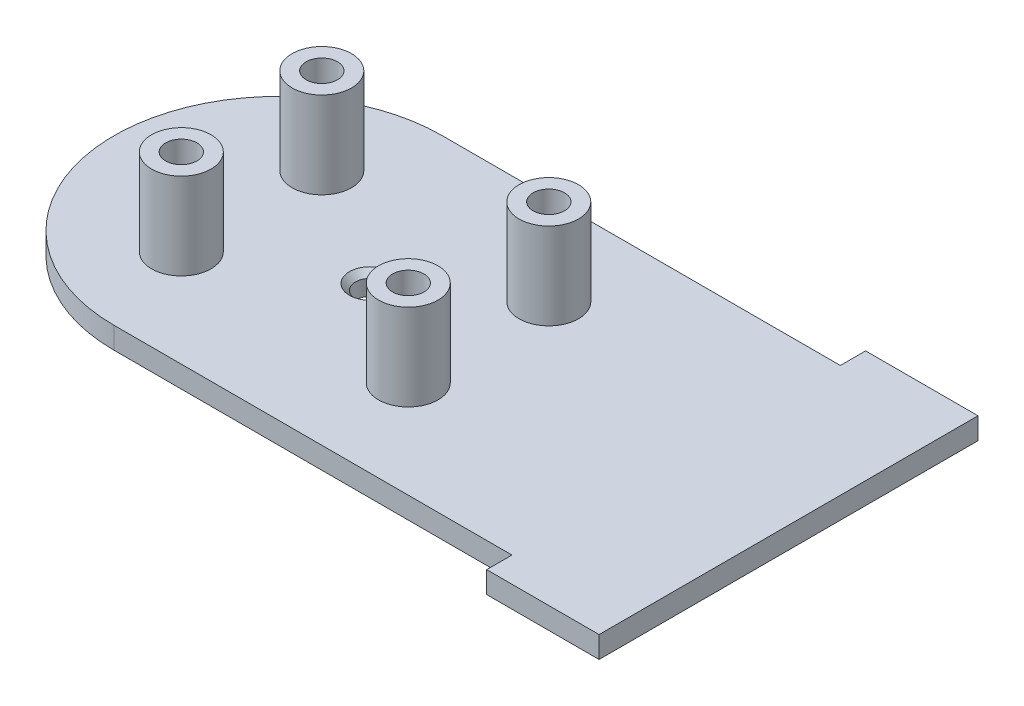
ISO-10303-21;
HEADER;
FILE_DESCRIPTION(('STEP AP214'),'2;1');
FILE_NAME('part.step','',(''),(''),'','','');
FILE_SCHEMA(('AUTOMOTIVE_DESIGN { 1 0 10303 214 1 1 1 1 }'));
ENDSEC;
DATA;
#1=APPLICATION_CONTEXT('core data for automotive mechanical design processes');
#2=APPLICATION_PROTOCOL_DEFINITION('international standard','automotive_design',2000,#1);
#3=PRODUCT_CONTEXT('',#1,'mechanical');
#4=PRODUCT('Part','Part','',(#3));
#5=PRODUCT_RELATED_PRODUCT_CATEGORY('part','',(#4));
#6=PRODUCT_DEFINITION_FORMATION('','',#4);
#7=PRODUCT_DEFINITION_CONTEXT('part definition',#1,'design');
#8=PRODUCT_DEFINITION('design','',#6,#7);
#9=PRODUCT_DEFINITION_SHAPE('','',#8);
#10=(LENGTH_UNIT() NAMED_UNIT(*) SI_UNIT(.MILLI.,.METRE.));
#11=(NAMED_UNIT(*) PLANE_ANGLE_UNIT() SI_UNIT($,.RADIAN.));
#12=(NAMED_UNIT(*) SI_UNIT($,.STERADIAN.) SOLID_ANGLE_UNIT());
#13=UNCERTAINTY_MEASURE_WITH_UNIT(LENGTH_MEASURE(1.E-05),#10,'distance_accuracy_value','');
#14=(GEOMETRIC_REPRESENTATION_CONTEXT(3) GLOBAL_UNCERTAINTY_ASSIGNED_CONTEXT((#13)) GLOBAL_UNIT_ASSIGNED_CONTEXT((#10,
#11,#12)) REPRESENTATION_CONTEXT('',''));
#15=CARTESIAN_POINT('',(0.,0.,0.));
#16=DIRECTION('',(0.,0.,1.));
#17=DIRECTION('',(1.,0.,0.));
#18=AXIS2_PLACEMENT_3D('',#15,#16,#17);
#19=CARTESIAN_POINT('',(8.5,0.,0.));
#20=DIRECTION('',(0.,1.,0.));
#21=DIRECTION('',(0.,0.,1.));
#22=AXIS2_PLACEMENT_3D('',#19,#20,#21);
#23=CYLINDRICAL_SURFACE('',#22,1.35);
#24=CARTESIAN_POINT('',(8.5,0.,0.));
#25=DIRECTION('',(0.,1.,0.));
#26=DIRECTION('',(0.,0.,1.));
#27=AXIS2_PLACEMENT_3D('',#24,#25,#26);
#28=CIRCLE('',#27,1.35);
#29=CARTESIAN_POINT('',(8.5,0.,1.35));
#30=VERTEX_POINT('',#29);
#31=EDGE_CURVE('E208',#30,#30,#28,.T.);
#32=ORIENTED_EDGE('',*,*,#31,.F.);
#33=EDGE_LOOP('',(#32));
#34=FACE_BOUND('',#33,.T.);
#35=CARTESIAN_POINT('',(8.5,1.45000000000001,0.));
#36=DIRECTION('',(0.,1.,0.));
#37=DIRECTION('',(0.,0.,1.));
#38=AXIS2_PLACEMENT_3D('',#35,#36,#37);
#39=CIRCLE('',#38,1.35);
#40=CARTESIAN_POINT('',(8.5,1.45000000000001,1.35));
#41=VERTEX_POINT('',#40);
#42=EDGE_CURVE('E207',#41,#41,#39,.F.);
#43=ORIENTED_EDGE('',*,*,#42,.F.);
#44=EDGE_LOOP('',(#43));
#45=FACE_BOUND('',#44,.T.);
#46=ADVANCED_FACE('F44',(#34,#45),#23,.F.);
#47=CARTESIAN_POINT('',(0.,2.,0.));
#48=DIRECTION('',(0.,-1.,0.));
#49=DIRECTION('',(0.,0.,-1.));
#50=AXIS2_PLACEMENT_3D('',#47,#48,#49);
#51=CYLINDRICAL_SURFACE('',#50,15.19);
#52=CARTESIAN_POINT('',(0.,0.,0.));
#53=DIRECTION('',(0.,1.,0.));
#54=DIRECTION('',(0.,0.,1.));
#55=AXIS2_PLACEMENT_3D('',#52,#53,#54);
#56=CIRCLE('',#55,15.19);
#57=CARTESIAN_POINT('',(0.,0.,-15.19));
#58=VERTEX_POINT('',#57);
#59=CARTESIAN_POINT('',(0.,0.,15.19));
#60=VERTEX_POINT('',#59);
#61=EDGE_CURVE('E212',#58,#60,#56,.T.);
#62=ORIENTED_EDGE('',*,*,#61,.T.);
#63=DIRECTION('',(0.,-1.,0.));
#64=VECTOR('',#63,1.);
#65=CARTESIAN_POINT('',(0.,2.,15.19));
#66=LINE('',#65,#64);
#67=CARTESIAN_POINT('',(0.,2.,15.19));
#68=VERTEX_POINT('',#67);
#69=EDGE_CURVE('E12',#68,#60,#66,.T.);
#70=ORIENTED_EDGE('',*,*,#69,.F.);
#71=CARTESIAN_POINT('',(0.,2.,0.));
#72=DIRECTION('',(0.,1.,0.));
#73=DIRECTION('',(0.,0.,1.));
#74=AXIS2_PLACEMENT_3D('',#71,#72,#73);
#75=CIRCLE('',#74,15.19);
#76=CARTESIAN_POINT('',(0.,2.,-15.19));
#77=VERTEX_POINT('',#76);
#78=EDGE_CURVE('E213',#77,#68,#75,.T.);
#79=ORIENTED_EDGE('',*,*,#78,.F.);
#80=DIRECTION('',(0.,-1.,0.));
#81=VECTOR('',#80,1.);
#82=CARTESIAN_POINT('',(0.,2.,-15.19));
#83=LINE('',#82,#81);
#84=EDGE_CURVE('E64',#77,#58,#83,.T.);
#85=ORIENTED_EDGE('',*,*,#84,.T.);
#86=EDGE_LOOP('',(#62,#70,#79,#85));
#87=FACE_BOUND('',#86,.T.);
#88=ADVANCED_FACE('F298',(#87),#51,.T.);
#89=CARTESIAN_POINT('',(0.,2.,15.19));
#90=DIRECTION('',(0.,0.,-1.));
#91=DIRECTION('',(-1.,0.,0.));
#92=AXIS2_PLACEMENT_3D('',#89,#90,#91);
#93=PLANE('',#92);
#94=DIRECTION('',(1.,0.,0.));
#95=VECTOR('',#94,1.);
#96=CARTESIAN_POINT('',(0.,0.,15.19));
#97=LINE('',#96,#95);
#98=CARTESIAN_POINT('',(36.825,0.,15.19));
#99=VERTEX_POINT('',#98);
#100=EDGE_CURVE('E240',#60,#99,#97,.T.);
#101=ORIENTED_EDGE('',*,*,#100,.T.);
#102=DIRECTION('',(0.,-1.,0.));
#103=VECTOR('',#102,1.);
#104=CARTESIAN_POINT('',(36.825,2.,15.19));
#105=LINE('',#104,#103);
#106=CARTESIAN_POINT('',(36.825,2.,15.19));
#107=VERTEX_POINT('',#106);
#108=EDGE_CURVE('E55',#107,#99,#105,.T.);
#109=ORIENTED_EDGE('',*,*,#108,.F.);
#110=DIRECTION('',(1.,0.,0.));
#111=VECTOR('',#110,1.);
#112=CARTESIAN_POINT('',(0.,2.,15.19));
#113=LINE('',#112,#111);
#114=EDGE_CURVE('E217',#68,#107,#113,.T.);
#115=ORIENTED_EDGE('',*,*,#114,.F.);
#116=ORIENTED_EDGE('',*,*,#69,.T.);
#117=EDGE_LOOP('',(#101,#109,#115,#116));
#118=FACE_BOUND('',#117,.T.);
#119=ADVANCED_FACE('F303',(#118),#93,.F.);
#120=CARTESIAN_POINT('',(36.825,2.,15.19));
#121=DIRECTION('',(1.,0.,0.));
#122=DIRECTION('',(0.,0.,-1.));
#123=AXIS2_PLACEMENT_3D('',#120,#121,#122);
#124=PLANE('',#123);
#125=DIRECTION('',(0.,0.,1.));
#126=VECTOR('',#125,1.);
#127=CARTESIAN_POINT('',(36.825,0.,15.19));
#128=LINE('',#127,#126);
#129=CARTESIAN_POINT('',(36.825,0.,17.5294293));
#130=VERTEX_POINT('',#129);
#131=EDGE_CURVE('E243',#99,#130,#128,.T.);
#132=ORIENTED_EDGE('',*,*,#131,.T.);
#133=DIRECTION('',(0.,-1.,0.));
#134=VECTOR('',#133,1.);
#135=CARTESIAN_POINT('',(36.825,2.,17.5294293));
#136=LINE('',#135,#134);
#137=CARTESIAN_POINT('',(36.825,2.,17.5294293));
#138=VERTEX_POINT('',#137);
#139=EDGE_CURVE('E269',#138,#130,#136,.T.);
#140=ORIENTED_EDGE('',*,*,#139,.F.);
#141=DIRECTION('',(0.,0.,1.));
#142=VECTOR('',#141,1.);
#143=CARTESIAN_POINT('',(36.825,2.,15.19));
#144=LINE('',#143,#142);
#145=EDGE_CURVE('E221',#107,#138,#144,.T.);
#146=ORIENTED_EDGE('',*,*,#145,.F.);
#147=ORIENTED_EDGE('',*,*,#108,.T.);
#148=EDGE_LOOP('',(#132,#140,#146,#147));
#149=FACE_BOUND('',#148,.T.);
#150=ADVANCED_FACE('F305',(#149),#124,.F.);
#151=CARTESIAN_POINT('',(47.225,2.,17.5294293));
#152=DIRECTION('',(0.,0.,1.));
#153=DIRECTION('',(1.,0.,0.));
#154=AXIS2_PLACEMENT_3D('',#151,#152,#153);
#155=PLANE('',#154);
#156=DIRECTION('',(-1.,0.,0.));
#157=VECTOR('',#156,1.);
#158=CARTESIAN_POINT('',(47.225,0.,17.5294293));
#159=LINE('',#158,#157);
#160=CARTESIAN_POINT('',(47.225,0.,17.5294293));
#161=VERTEX_POINT('',#160);
#162=EDGE_CURVE('E247',#161,#130,#159,.T.);
#163=ORIENTED_EDGE('',*,*,#162,.F.);
#164=DIRECTION('',(0.,-1.,0.));
#165=VECTOR('',#164,1.);
#166=CARTESIAN_POINT('',(47.225,2.,17.5294293));
#167=LINE('',#166,#165);
#168=CARTESIAN_POINT('',(47.225,2.,17.5294293));
#169=VERTEX_POINT('',#168);
#170=EDGE_CURVE('E112',#169,#161,#167,.T.);
#171=ORIENTED_EDGE('',*,*,#170,.F.);
#172=DIRECTION('',(-1.,0.,0.));
#173=VECTOR('',#172,1.);
#174=CARTESIAN_POINT('',(47.225,2.,17.5294293));
#175=LINE('',#174,#173);
#176=EDGE_CURVE('E224',#169,#138,#175,.T.);
#177=ORIENTED_EDGE('',*,*,#176,.T.);
#178=ORIENTED_EDGE('',*,*,#139,.T.);
#179=EDGE_LOOP('',(#163,#171,#177,#178));
#180=FACE_BOUND('',#179,.T.);
#181=ADVANCED_FACE('F306',(#180),#155,.T.);
#182=CARTESIAN_POINT('',(47.225,2.,-17.5294293));
#183=DIRECTION('',(1.,0.,0.));
#184=DIRECTION('',(0.,0.,-1.));
#185=AXIS2_PLACEMENT_3D('',#182,#183,#184);
#186=PLANE('',#185);
#187=DIRECTION('',(0.,0.,1.));
#188=VECTOR('',#187,1.);
#189=CARTESIAN_POINT('',(47.225,0.,-17.5294293));
#190=LINE('',#189,#188);
#191=CARTESIAN_POINT('',(47.225,0.,-17.5294293));
#192=VERTEX_POINT('',#191);
#193=EDGE_CURVE('E251',#192,#161,#190,.T.);
#194=ORIENTED_EDGE('',*,*,#193,.F.);
#195=DIRECTION('',(0.,-1.,0.));
#196=VECTOR('',#195,1.);
#197=CARTESIAN_POINT('',(47.225,2.,-17.5294293));
#198=LINE('',#197,#196);
#199=CARTESIAN_POINT('',(47.225,2.,-17.5294293));
#200=VERTEX_POINT('',#199);
#201=EDGE_CURVE('E105',#200,#192,#198,.T.);
#202=ORIENTED_EDGE('',*,*,#201,.F.);
#203=DIRECTION('',(0.,0.,1.));
#204=VECTOR('',#203,1.);
#205=CARTESIAN_POINT('',(47.225,2.,-17.5294293));
#206=LINE('',#205,#204);
#207=EDGE_CURVE('E227',#200,#169,#206,.T.);
#208=ORIENTED_EDGE('',*,*,#207,.T.);
#209=ORIENTED_EDGE('',*,*,#170,.T.);
#210=EDGE_LOOP('',(#194,#202,#208,#209));
#211=FACE_BOUND('',#210,.T.);
#212=ADVANCED_FACE('F307',(#211),#186,.T.);
#213=CARTESIAN_POINT('',(38.325,2.,-17.5294293));
#214=DIRECTION('',(0.,0.,-1.));
#215=DIRECTION('',(-1.,0.,0.));
#216=AXIS2_PLACEMENT_3D('',#213,#214,#215);
#217=PLANE('',#216);
#218=DIRECTION('',(1.,0.,0.));
#219=VECTOR('',#218,1.);
#220=CARTESIAN_POINT('',(38.325,0.,-17.5294293));
#221=LINE('',#220,#219);
#222=CARTESIAN_POINT('',(36.825,0.,-17.5294293));
#223=VERTEX_POINT('',#222);
#224=EDGE_CURVE('E255',#223,#192,#221,.T.);
#225=ORIENTED_EDGE('',*,*,#224,.F.);
#226=DIRECTION('',(0.,-1.,0.));
#227=VECTOR('',#226,1.);
#228=CARTESIAN_POINT('',(36.825,2.,-17.5294293));
#229=LINE('',#228,#227);
#230=CARTESIAN_POINT('',(36.825,2.,-17.5294293));
#231=VERTEX_POINT('',#230);
#232=EDGE_CURVE('E98',#231,#223,#229,.T.);
#233=ORIENTED_EDGE('',*,*,#232,.F.);
#234=DIRECTION('',(1.,0.,0.));
#235=VECTOR('',#234,1.);
#236=CARTESIAN_POINT('',(38.325,2.,-17.5294293));
#237=LINE('',#236,#235);
#238=EDGE_CURVE('E230',#231,#200,#237,.T.);
#239=ORIENTED_EDGE('',*,*,#238,.T.);
#240=ORIENTED_EDGE('',*,*,#201,.T.);
#241=EDGE_LOOP('',(#225,#233,#239,#240));
#242=FACE_BOUND('',#241,.T.);
#243=ADVANCED_FACE('F308',(#242),#217,.T.);
#244=CARTESIAN_POINT('',(36.825,2.,-15.19));
#245=DIRECTION('',(-1.,0.,0.));
#246=DIRECTION('',(0.,0.,1.));
#247=AXIS2_PLACEMENT_3D('',#244,#245,#246);
#248=PLANE('',#247);
#249=DIRECTION('',(0.,0.,-1.));
#250=VECTOR('',#249,1.);
#251=CARTESIAN_POINT('',(36.825,0.,-15.19));
#252=LINE('',#251,#250);
#253=CARTESIAN_POINT('',(36.825,0.,-15.19));
#254=VERTEX_POINT('',#253);
#255=EDGE_CURVE('E259',#254,#223,#252,.T.);
#256=ORIENTED_EDGE('',*,*,#255,.F.);
#257=DIRECTION('',(0.,-1.,0.));
#258=VECTOR('',#257,1.);
#259=CARTESIAN_POINT('',(36.825,2.,-15.19));
#260=LINE('',#259,#258);
#261=CARTESIAN_POINT('',(36.825,2.,-15.19));
#262=VERTEX_POINT('',#261);
#263=EDGE_CURVE('E48',#262,#254,#260,.T.);
#264=ORIENTED_EDGE('',*,*,#263,.F.);
#265=DIRECTION('',(0.,0.,-1.));
#266=VECTOR('',#265,1.);
#267=CARTESIAN_POINT('',(36.825,2.,-15.19));
#268=LINE('',#267,#266);
#269=EDGE_CURVE('E233',#262,#231,#268,.T.);
#270=ORIENTED_EDGE('',*,*,#269,.T.);
#271=ORIENTED_EDGE('',*,*,#232,.T.);
#272=EDGE_LOOP('',(#256,#264,#270,#271));
#273=FACE_BOUND('',#272,.T.);
#274=ADVANCED_FACE('F46',(#273),#248,.T.);
#275=CARTESIAN_POINT('',(0.,2.,-15.19));
#276=DIRECTION('',(0.,0.,-1.));
#277=DIRECTION('',(-1.,0.,0.));
#278=AXIS2_PLACEMENT_3D('',#275,#276,#277);
#279=PLANE('',#278);
#280=DIRECTION('',(1.,0.,0.));
#281=VECTOR('',#280,1.);
#282=CARTESIAN_POINT('',(0.,0.,-15.19));
#283=LINE('',#282,#281);
#284=EDGE_CURVE('E218',#58,#254,#283,.T.);
#285=ORIENTED_EDGE('',*,*,#284,.F.);
#286=ORIENTED_EDGE('',*,*,#84,.F.);
#287=DIRECTION('',(1.,0.,0.));
#288=VECTOR('',#287,1.);
#289=CARTESIAN_POINT('',(0.,2.,-15.19));
#290=LINE('',#289,#288);
#291=EDGE_CURVE('E234',#77,#262,#290,.T.);
#292=ORIENTED_EDGE('',*,*,#291,.T.);
#293=ORIENTED_EDGE('',*,*,#263,.T.);
#294=EDGE_LOOP('',(#285,#286,#292,#293));
#295=FACE_BOUND('',#294,.T.);
#296=ADVANCED_FACE('F291',(#295),#279,.T.);
#297=CARTESIAN_POINT('',(0.,2.,0.));
#298=DIRECTION('',(0.,1.,0.));
#299=DIRECTION('',(0.,0.,1.));
#300=AXIS2_PLACEMENT_3D('',#297,#298,#299);
#301=PLANE('',#300);
#302=CARTESIAN_POINT('',(18.225,2.,6.18311674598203));
#303=DIRECTION('',(0.,1.,0.));
#304=DIRECTION('',(0.,0.,1.));
#305=AXIS2_PLACEMENT_3D('',#302,#303,#304);
#306=CIRCLE('',#305,2.75);
#307=CARTESIAN_POINT('',(18.225,2.,8.93311674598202));
#308=VERTEX_POINT('',#307);
#309=EDGE_CURVE('E677',#308,#308,#306,.T.);
#310=ORIENTED_EDGE('',*,*,#309,.F.);
#311=EDGE_LOOP('',(#310));
#312=FACE_BOUND('',#311,.T.);
#313=CARTESIAN_POINT('',(-2.77500000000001,2.,6.18311674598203));
#314=DIRECTION('',(0.,1.,0.));
#315=DIRECTION('',(0.,0.,1.));
#316=AXIS2_PLACEMENT_3D('',#313,#314,#315);
#317=CIRCLE('',#316,2.75);
#318=CARTESIAN_POINT('',(-2.77500000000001,2.,8.93311674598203));
#319=VERTEX_POINT('',#318);
#320=EDGE_CURVE('E690',#319,#319,#317,.T.);
#321=ORIENTED_EDGE('',*,*,#320,.F.);
#322=EDGE_LOOP('',(#321));
#323=FACE_BOUND('',#322,.T.);
#324=CARTESIAN_POINT('',(18.225,2.,-6.81688325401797));
#325=DIRECTION('',(0.,1.,0.));
#326=DIRECTION('',(0.,0.,1.));
#327=AXIS2_PLACEMENT_3D('',#324,#325,#326);
#328=CIRCLE('',#327,2.75);
#329=CARTESIAN_POINT('',(18.225,2.,-4.06688325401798));
#330=VERTEX_POINT('',#329);
#331=EDGE_CURVE('E698',#330,#330,#328,.T.);
#332=ORIENTED_EDGE('',*,*,#331,.F.);
#333=EDGE_LOOP('',(#332));
#334=FACE_BOUND('',#333,.T.);
#335=CARTESIAN_POINT('',(-2.77500000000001,2.,-6.81688325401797));
#336=DIRECTION('',(0.,1.,0.));
#337=DIRECTION('',(0.,0.,1.));
#338=AXIS2_PLACEMENT_3D('',#335,#336,#337);
#339=CIRCLE('',#338,2.75);
#340=CARTESIAN_POINT('',(-2.77500000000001,2.,-4.06688325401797));
#341=VERTEX_POINT('',#340);
#342=EDGE_CURVE('E702',#341,#341,#339,.T.);
#343=ORIENTED_EDGE('',*,*,#342,.F.);
#344=EDGE_LOOP('',(#343));
#345=FACE_BOUND('',#344,.T.);
#346=CARTESIAN_POINT('',(8.5,2.,0.));
#347=DIRECTION('',(0.,1.,0.));
#348=DIRECTION('',(0.,0.,1.));
#349=AXIS2_PLACEMENT_3D('',#346,#347,#348);
#350=CIRCLE('',#349,1.9);
#351=CARTESIAN_POINT('',(8.5,2.,1.9));
#352=VERTEX_POINT('',#351);
#353=EDGE_CURVE('E200',#352,#352,#350,.T.);
#354=ORIENTED_EDGE('',*,*,#353,.F.);
#355=EDGE_LOOP('',(#354));
#356=FACE_BOUND('',#355,.T.);
#357=ORIENTED_EDGE('',*,*,#78,.T.);
#358=ORIENTED_EDGE('',*,*,#114,.T.);
#359=ORIENTED_EDGE('',*,*,#145,.T.);
#360=ORIENTED_EDGE('',*,*,#176,.F.);
#361=ORIENTED_EDGE('',*,*,#207,.F.);
#362=ORIENTED_EDGE('',*,*,#238,.F.);
#363=ORIENTED_EDGE('',*,*,#269,.F.);
#364=ORIENTED_EDGE('',*,*,#291,.F.);
#365=EDGE_LOOP('',(#357,#358,#359,#360,#361,#362,#363,#364));
#366=FACE_BOUND('',#365,.T.);
#367=ADVANCED_FACE('F290',(#312,#323,#334,#345,#356,#366),#301,.T.);
#368=CARTESIAN_POINT('',(0.,0.,0.));
#369=DIRECTION('',(0.,1.,0.));
#370=DIRECTION('',(0.,0.,1.));
#371=AXIS2_PLACEMENT_3D('',#368,#369,#370);
#372=PLANE('',#371);
#373=DIRECTION('',(0.,0.,1.));
#374=VECTOR('',#373,1.);
#375=CARTESIAN_POINT('',(4.5,0.,-6.5));
#376=LINE('',#375,#374);
#377=CARTESIAN_POINT('',(4.5,0.,-12.0980762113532));
#378=VERTEX_POINT('',#377);
#379=CARTESIAN_POINT('',(4.5,0.,10.09807621));
#380=VERTEX_POINT('',#379);
#381=EDGE_CURVE('E158',#378,#380,#376,.T.);
#382=ORIENTED_EDGE('',*,*,#381,.F.);
#383=DIRECTION('',(1.,0.,0.));
#384=VECTOR('',#383,1.);
#385=CARTESIAN_POINT('',(-10.2955549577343,0.,-12.0980762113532));
#386=LINE('',#385,#384);
#387=CARTESIAN_POINT('',(-4.5,0.,-12.0980762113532));
#388=VERTEX_POINT('',#387);
#389=EDGE_CURVE('E163',#388,#378,#386,.T.);
#390=ORIENTED_EDGE('',*,*,#389,.F.);
#391=DIRECTION('',(0.,0.,-1.));
#392=VECTOR('',#391,1.);
#393=CARTESIAN_POINT('',(-4.5,0.,-6.5));
#394=LINE('',#393,#392);
#395=CARTESIAN_POINT('',(-4.5,0.,10.09807621));
#396=VERTEX_POINT('',#395);
#397=EDGE_CURVE('E146',#396,#388,#394,.T.);
#398=ORIENTED_EDGE('',*,*,#397,.F.);
#399=DIRECTION('',(1.,0.,0.));
#400=VECTOR('',#399,1.);
#401=CARTESIAN_POINT('',(-10.2955549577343,0.,10.09807621));
#402=LINE('',#401,#400);
#403=EDGE_CURVE('E182',#396,#380,#402,.T.);
#404=ORIENTED_EDGE('',*,*,#403,.T.);
#405=EDGE_LOOP('',(#382,#390,#398,#404));
#406=FACE_BOUND('',#405,.T.);
#407=ORIENTED_EDGE('',*,*,#31,.T.);
#408=EDGE_LOOP('',(#407));
#409=FACE_BOUND('',#408,.T.);
#410=ORIENTED_EDGE('',*,*,#61,.F.);
#411=ORIENTED_EDGE('',*,*,#284,.T.);
#412=ORIENTED_EDGE('',*,*,#255,.T.);
#413=ORIENTED_EDGE('',*,*,#224,.T.);
#414=ORIENTED_EDGE('',*,*,#193,.T.);
#415=ORIENTED_EDGE('',*,*,#162,.T.);
#416=ORIENTED_EDGE('',*,*,#131,.F.);
#417=ORIENTED_EDGE('',*,*,#100,.F.);
#418=EDGE_LOOP('',(#410,#411,#412,#413,#414,#415,#416,#417));
#419=FACE_BOUND('',#418,.T.);
#420=ADVANCED_FACE('F170',(#406,#409,#419),#372,.F.);
#421=CARTESIAN_POINT('',(8.5,1.10000000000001,0.));
#422=DIRECTION('',(0.,1.,0.));
#423=DIRECTION('',(0.,0.,1.));
#424=AXIS2_PLACEMENT_3D('',#421,#422,#423);
#425=CONICAL_SURFACE('',#424,1.,0.785398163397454);
#426=ORIENTED_EDGE('',*,*,#353,.T.);
#427=EDGE_LOOP('',(#426));
#428=FACE_BOUND('',#427,.T.);
#429=ORIENTED_EDGE('',*,*,#42,.T.);
#430=EDGE_LOOP('',(#429));
#431=FACE_BOUND('',#430,.T.);
#432=ADVANCED_FACE('F327',(#428,#431),#425,.F.);
#433=CARTESIAN_POINT('',(-4.5,1.5,-6.5));
#434=DIRECTION('',(-1.,0.,0.));
#435=DIRECTION('',(0.,0.,1.));
#436=AXIS2_PLACEMENT_3D('',#433,#434,#435);
#437=PLANE('',#436);
#438=ORIENTED_EDGE('',*,*,#397,.T.);
#439=DIRECTION('',(0.,-0.258819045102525,-0.965925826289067));
#440=VECTOR('',#439,1.);
#441=CARTESIAN_POINT('',(-4.5,1.5,-6.5));
#442=LINE('',#441,#440);
#443=CARTESIAN_POINT('',(-4.5,1.5,-6.5));
#444=VERTEX_POINT('',#443);
#445=EDGE_CURVE('E150',#444,#388,#442,.T.);
#446=ORIENTED_EDGE('',*,*,#445,.F.);
#447=DIRECTION('',(0.,0.,-1.));
#448=VECTOR('',#447,1.);
#449=CARTESIAN_POINT('',(-4.5,1.5,-6.5));
#450=LINE('',#449,#448);
#451=CARTESIAN_POINT('',(-4.5,1.5,4.5));
#452=VERTEX_POINT('',#451);
#453=EDGE_CURVE('E188',#452,#444,#450,.T.);
#454=ORIENTED_EDGE('',*,*,#453,.F.);
#455=DIRECTION('',(0.,0.258819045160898,-0.965925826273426));
#456=VECTOR('',#455,1.);
#457=CARTESIAN_POINT('',(-4.5,1.5,4.5));
#458=LINE('',#457,#456);
#459=EDGE_CURVE('E152',#396,#452,#458,.T.);
#460=ORIENTED_EDGE('',*,*,#459,.F.);
#461=EDGE_LOOP('',(#438,#446,#454,#460));
#462=FACE_BOUND('',#461,.T.);
#463=ADVANCED_FACE('F148',(#462),#437,.F.);
#464=CARTESIAN_POINT('',(4.5,1.5,-6.5));
#465=DIRECTION('',(1.,0.,0.));
#466=DIRECTION('',(0.,0.,-1.));
#467=AXIS2_PLACEMENT_3D('',#464,#465,#466);
#468=PLANE('',#467);
#469=ORIENTED_EDGE('',*,*,#381,.T.);
#470=DIRECTION('',(0.,0.258819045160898,-0.965925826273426));
#471=VECTOR('',#470,1.);
#472=CARTESIAN_POINT('',(4.5,1.5,4.5));
#473=LINE('',#472,#471);
#474=CARTESIAN_POINT('',(4.5,1.5,4.5));
#475=VERTEX_POINT('',#474);
#476=EDGE_CURVE('E178',#380,#475,#473,.T.);
#477=ORIENTED_EDGE('',*,*,#476,.T.);
#478=DIRECTION('',(0.,0.,1.));
#479=VECTOR('',#478,1.);
#480=CARTESIAN_POINT('',(4.5,1.5,-6.5));
#481=LINE('',#480,#479);
#482=CARTESIAN_POINT('',(4.5,1.5,-6.5));
#483=VERTEX_POINT('',#482);
#484=EDGE_CURVE('E193',#483,#475,#481,.T.);
#485=ORIENTED_EDGE('',*,*,#484,.F.);
#486=DIRECTION('',(0.,-0.258819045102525,-0.965925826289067));
#487=VECTOR('',#486,1.);
#488=CARTESIAN_POINT('',(4.5,1.5,-6.5));
#489=LINE('',#488,#487);
#490=EDGE_CURVE('E173',#483,#378,#489,.T.);
#491=ORIENTED_EDGE('',*,*,#490,.T.);
#492=EDGE_LOOP('',(#469,#477,#485,#491));
#493=FACE_BOUND('',#492,.T.);
#494=ADVANCED_FACE('F358',(#493),#468,.F.);
#495=CARTESIAN_POINT('',(0.,1.5,0.));
#496=DIRECTION('',(0.,1.,0.));
#497=DIRECTION('',(0.,0.,1.));
#498=AXIS2_PLACEMENT_3D('',#495,#496,#497);
#499=PLANE('',#498);
#500=ORIENTED_EDGE('',*,*,#453,.T.);
#501=DIRECTION('',(1.,0.,0.));
#502=VECTOR('',#501,1.);
#503=CARTESIAN_POINT('',(-4.5,1.5,-6.5));
#504=LINE('',#503,#502);
#505=EDGE_CURVE('E166',#444,#483,#504,.T.);
#506=ORIENTED_EDGE('',*,*,#505,.T.);
#507=ORIENTED_EDGE('',*,*,#484,.T.);
#508=DIRECTION('',(-1.,0.,0.));
#509=VECTOR('',#508,1.);
#510=CARTESIAN_POINT('',(-4.5,1.5,4.5));
#511=LINE('',#510,#509);
#512=EDGE_CURVE('E197',#475,#452,#511,.T.);
#513=ORIENTED_EDGE('',*,*,#512,.T.);
#514=EDGE_LOOP('',(#500,#506,#507,#513));
#515=FACE_BOUND('',#514,.T.);
#516=ADVANCED_FACE('F364',(#515),#499,.F.);
#517=CARTESIAN_POINT('',(-10.2955549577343,1.5,4.5));
#518=DIRECTION('',(0.,-0.965925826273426,-0.258819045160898));
#519=DIRECTION('',(0.,0.258819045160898,-0.965925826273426));
#520=AXIS2_PLACEMENT_3D('',#517,#518,#519);
#521=PLANE('',#520);
#522=ORIENTED_EDGE('',*,*,#459,.T.);
#523=ORIENTED_EDGE('',*,*,#512,.F.);
#524=ORIENTED_EDGE('',*,*,#476,.F.);
#525=ORIENTED_EDGE('',*,*,#403,.F.);
#526=EDGE_LOOP('',(#522,#523,#524,#525));
#527=FACE_BOUND('',#526,.T.);
#528=ADVANCED_FACE('F372',(#527),#521,.T.);
#529=CARTESIAN_POINT('',(-10.2955549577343,1.5,-6.5));
#530=DIRECTION('',(0.,-0.965925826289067,0.258819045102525));
#531=DIRECTION('',(0.,-0.258819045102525,-0.965925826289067));
#532=AXIS2_PLACEMENT_3D('',#529,#530,#531);
#533=PLANE('',#532);
#534=ORIENTED_EDGE('',*,*,#445,.T.);
#535=ORIENTED_EDGE('',*,*,#389,.T.);
#536=ORIENTED_EDGE('',*,*,#490,.F.);
#537=ORIENTED_EDGE('',*,*,#505,.F.);
#538=EDGE_LOOP('',(#534,#535,#536,#537));
#539=FACE_BOUND('',#538,.T.);
#540=ADVANCED_FACE('F162',(#539),#533,.T.);
#541=CARTESIAN_POINT('',(-2.77500000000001,10.,-6.81688325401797));
#542=DIRECTION('',(0.,-1.,0.));
#543=DIRECTION('',(0.,0.,-1.));
#544=AXIS2_PLACEMENT_3D('',#541,#542,#543);
#545=CYLINDRICAL_SURFACE('',#544,2.75);
#546=CARTESIAN_POINT('',(-2.77500000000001,10.,-6.81688325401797));
#547=DIRECTION('',(0.,1.,0.));
#548=DIRECTION('',(0.,0.,1.));
#549=AXIS2_PLACEMENT_3D('',#546,#547,#548);
#550=CIRCLE('',#549,2.75);
#551=CARTESIAN_POINT('',(-2.77500000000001,10.,-4.06688325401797));
#552=VERTEX_POINT('',#551);
#553=EDGE_CURVE('E187',#552,#552,#550,.T.);
#554=ORIENTED_EDGE('',*,*,#553,.F.);
#555=EDGE_LOOP('',(#554));
#556=FACE_BOUND('',#555,.T.);
#557=ORIENTED_EDGE('',*,*,#342,.T.);
#558=EDGE_LOOP('',(#557));
#559=FACE_BOUND('',#558,.T.);
#560=ADVANCED_FACE('F387',(#556,#559),#545,.T.);
#561=CARTESIAN_POINT('',(-2.77500000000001,10.,-6.81688325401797));
#562=DIRECTION('',(0.,1.,0.));
#563=DIRECTION('',(0.,0.,1.));
#564=AXIS2_PLACEMENT_3D('',#561,#562,#563);
#565=PLANE('',#564);
#566=CARTESIAN_POINT('',(-2.77500000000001,10.,-6.81688325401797));
#567=DIRECTION('',(0.,1.,0.));
#568=DIRECTION('',(0.,0.,1.));
#569=AXIS2_PLACEMENT_3D('',#566,#567,#568);
#570=CIRCLE('',#569,1.45);
#571=CARTESIAN_POINT('',(-2.77500000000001,10.,-5.36688325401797));
#572=VERTEX_POINT('',#571);
#573=EDGE_CURVE('E672',#572,#572,#570,.T.);
#574=ORIENTED_EDGE('',*,*,#573,.F.);
#575=EDGE_LOOP('',(#574));
#576=FACE_BOUND('',#575,.T.);
#577=ORIENTED_EDGE('',*,*,#553,.T.);
#578=EDGE_LOOP('',(#577));
#579=FACE_BOUND('',#578,.T.);
#580=ADVANCED_FACE('F394',(#576,#579),#565,.T.);
#581=CARTESIAN_POINT('',(18.225,10.,-6.81688325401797));
#582=DIRECTION('',(0.,-1.,0.));
#583=DIRECTION('',(0.,0.,-1.));
#584=AXIS2_PLACEMENT_3D('',#581,#582,#583);
#585=CYLINDRICAL_SURFACE('',#584,2.75);
#586=CARTESIAN_POINT('',(18.225,10.,-6.81688325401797));
#587=DIRECTION('',(0.,1.,0.));
#588=DIRECTION('',(0.,0.,1.));
#589=AXIS2_PLACEMENT_3D('',#586,#587,#588);
#590=CIRCLE('',#589,2.75);
#591=CARTESIAN_POINT('',(18.225,10.,-4.06688325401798));
#592=VERTEX_POINT('',#591);
#593=EDGE_CURVE('E694',#592,#592,#590,.T.);
#594=ORIENTED_EDGE('',*,*,#593,.F.);
#595=EDGE_LOOP('',(#594));
#596=FACE_BOUND('',#595,.T.);
#597=ORIENTED_EDGE('',*,*,#331,.T.);
#598=EDGE_LOOP('',(#597));
#599=FACE_BOUND('',#598,.T.);
#600=ADVANCED_FACE('F403',(#596,#599),#585,.T.);
#601=CARTESIAN_POINT('',(18.225,10.,-6.81688325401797));
#602=DIRECTION('',(0.,1.,0.));
#603=DIRECTION('',(0.,0.,1.));
#604=AXIS2_PLACEMENT_3D('',#601,#602,#603);
#605=PLANE('',#604);
#606=CARTESIAN_POINT('',(18.225,10.,-6.81688325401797));
#607=DIRECTION('',(0.,1.,0.));
#608=DIRECTION('',(0.,0.,1.));
#609=AXIS2_PLACEMENT_3D('',#606,#607,#608);
#610=CIRCLE('',#609,1.45);
#611=CARTESIAN_POINT('',(18.225,10.,-5.36688325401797));
#612=VERTEX_POINT('',#611);
#613=EDGE_CURVE('E680',#612,#612,#610,.T.);
#614=ORIENTED_EDGE('',*,*,#613,.F.);
#615=EDGE_LOOP('',(#614));
#616=FACE_BOUND('',#615,.T.);
#617=ORIENTED_EDGE('',*,*,#593,.T.);
#618=EDGE_LOOP('',(#617));
#619=FACE_BOUND('',#618,.T.);
#620=ADVANCED_FACE('F412',(#616,#619),#605,.T.);
#621=CARTESIAN_POINT('',(-2.77500000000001,10.,6.18311674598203));
#622=DIRECTION('',(0.,-1.,0.));
#623=DIRECTION('',(0.,0.,-1.));
#624=AXIS2_PLACEMENT_3D('',#621,#622,#623);
#625=CYLINDRICAL_SURFACE('',#624,2.75);
#626=CARTESIAN_POINT('',(-2.77500000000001,10.,6.18311674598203));
#627=DIRECTION('',(0.,1.,0.));
#628=DIRECTION('',(0.,0.,1.));
#629=AXIS2_PLACEMENT_3D('',#626,#627,#628);
#630=CIRCLE('',#629,2.75);
#631=CARTESIAN_POINT('',(-2.77500000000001,10.,8.93311674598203));
#632=VERTEX_POINT('',#631);
#633=EDGE_CURVE('E688',#632,#632,#630,.T.);
#634=ORIENTED_EDGE('',*,*,#633,.F.);
#635=EDGE_LOOP('',(#634));
#636=FACE_BOUND('',#635,.T.);
#637=ORIENTED_EDGE('',*,*,#320,.T.);
#638=EDGE_LOOP('',(#637));
#639=FACE_BOUND('',#638,.T.);
#640=ADVANCED_FACE('F420',(#636,#639),#625,.T.);
#641=CARTESIAN_POINT('',(-2.77500000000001,10.,6.18311674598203));
#642=DIRECTION('',(0.,1.,0.));
#643=DIRECTION('',(0.,0.,1.));
#644=AXIS2_PLACEMENT_3D('',#641,#642,#643);
#645=PLANE('',#644);
#646=CARTESIAN_POINT('',(-2.77500000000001,10.,6.18311674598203));
#647=DIRECTION('',(0.,1.,0.));
#648=DIRECTION('',(0.,0.,1.));
#649=AXIS2_PLACEMENT_3D('',#646,#647,#648);
#650=CIRCLE('',#649,1.45);
#651=CARTESIAN_POINT('',(-2.77500000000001,10.,7.63311674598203));
#652=VERTEX_POINT('',#651);
#653=EDGE_CURVE('E734',#652,#652,#650,.T.);
#654=ORIENTED_EDGE('',*,*,#653,.F.);
#655=EDGE_LOOP('',(#654));
#656=FACE_BOUND('',#655,.T.);
#657=ORIENTED_EDGE('',*,*,#633,.T.);
#658=EDGE_LOOP('',(#657));
#659=FACE_BOUND('',#658,.T.);
#660=ADVANCED_FACE('F428',(#656,#659),#645,.T.);
#661=CARTESIAN_POINT('',(18.225,10.,6.18311674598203));
#662=DIRECTION('',(0.,-1.,0.));
#663=DIRECTION('',(0.,0.,-1.));
#664=AXIS2_PLACEMENT_3D('',#661,#662,#663);
#665=CYLINDRICAL_SURFACE('',#664,2.75);
#666=CARTESIAN_POINT('',(18.225,10.,6.18311674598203));
#667=DIRECTION('',(0.,1.,0.));
#668=DIRECTION('',(0.,0.,1.));
#669=AXIS2_PLACEMENT_3D('',#666,#667,#668);
#670=CIRCLE('',#669,2.75);
#671=CARTESIAN_POINT('',(18.225,10.,8.93311674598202));
#672=VERTEX_POINT('',#671);
#673=EDGE_CURVE('E671',#672,#672,#670,.T.);
#674=ORIENTED_EDGE('',*,*,#673,.F.);
#675=EDGE_LOOP('',(#674));
#676=FACE_BOUND('',#675,.T.);
#677=ORIENTED_EDGE('',*,*,#309,.T.);
#678=EDGE_LOOP('',(#677));
#679=FACE_BOUND('',#678,.T.);
#680=ADVANCED_FACE('F435',(#676,#679),#665,.T.);
#681=CARTESIAN_POINT('',(18.225,10.,6.18311674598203));
#682=DIRECTION('',(0.,1.,0.));
#683=DIRECTION('',(0.,0.,1.));
#684=AXIS2_PLACEMENT_3D('',#681,#682,#683);
#685=PLANE('',#684);
#686=CARTESIAN_POINT('',(18.225,10.,6.18311674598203));
#687=DIRECTION('',(0.,1.,0.));
#688=DIRECTION('',(0.,0.,1.));
#689=AXIS2_PLACEMENT_3D('',#686,#687,#688);
#690=CIRCLE('',#689,1.45);
#691=CARTESIAN_POINT('',(18.225,10.,7.63311674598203));
#692=VERTEX_POINT('',#691);
#693=EDGE_CURVE('E735',#692,#692,#690,.T.);
#694=ORIENTED_EDGE('',*,*,#693,.F.);
#695=EDGE_LOOP('',(#694));
#696=FACE_BOUND('',#695,.T.);
#697=ORIENTED_EDGE('',*,*,#673,.T.);
#698=EDGE_LOOP('',(#697));
#699=FACE_BOUND('',#698,.T.);
#700=ADVANCED_FACE('F443',(#696,#699),#685,.T.);
#701=CARTESIAN_POINT('',(18.225,5.,6.18311674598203));
#702=DIRECTION('',(0.,1.,0.));
#703=DIRECTION('',(0.,0.,1.));
#704=AXIS2_PLACEMENT_3D('',#701,#702,#703);
#705=CYLINDRICAL_SURFACE('',#704,1.45);
#706=CARTESIAN_POINT('',(18.225,5.,6.18311674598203));
#707=DIRECTION('',(0.,1.,0.));
#708=DIRECTION('',(0.,0.,1.));
#709=AXIS2_PLACEMENT_3D('',#706,#707,#708);
#710=CIRCLE('',#709,1.45);
#711=CARTESIAN_POINT('',(18.225,5.,7.63311674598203));
#712=VERTEX_POINT('',#711);
#713=EDGE_CURVE('E746',#712,#712,#710,.T.);
#714=ORIENTED_EDGE('',*,*,#713,.F.);
#715=EDGE_LOOP('',(#714));
#716=FACE_BOUND('',#715,.T.);
#717=ORIENTED_EDGE('',*,*,#693,.T.);
#718=EDGE_LOOP('',(#717));
#719=FACE_BOUND('',#718,.T.);
#720=ADVANCED_FACE('F450',(#716,#719),#705,.F.);
#721=CARTESIAN_POINT('',(18.225,5.,6.18311674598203));
#722=DIRECTION('',(0.,1.,0.));
#723=DIRECTION('',(0.,0.,1.));
#724=AXIS2_PLACEMENT_3D('',#721,#722,#723);
#725=PLANE('',#724);
#726=ORIENTED_EDGE('',*,*,#713,.T.);
#727=EDGE_LOOP('',(#726));
#728=FACE_BOUND('',#727,.T.);
#729=ADVANCED_FACE('F458',(#728),#725,.T.);
#730=CARTESIAN_POINT('',(-2.77500000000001,5.,6.18311674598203));
#731=DIRECTION('',(0.,1.,0.));
#732=DIRECTION('',(0.,0.,1.));
#733=AXIS2_PLACEMENT_3D('',#730,#731,#732);
#734=CYLINDRICAL_SURFACE('',#733,1.45);
#735=CARTESIAN_POINT('',(-2.77500000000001,5.,6.18311674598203));
#736=DIRECTION('',(0.,1.,0.));
#737=DIRECTION('',(0.,0.,1.));
#738=AXIS2_PLACEMENT_3D('',#735,#736,#737);
#739=CIRCLE('',#738,1.45);
#740=CARTESIAN_POINT('',(-2.77500000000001,5.,7.63311674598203));
#741=VERTEX_POINT('',#740);
#742=EDGE_CURVE('E683',#741,#741,#739,.T.);
#743=ORIENTED_EDGE('',*,*,#742,.F.);
#744=EDGE_LOOP('',(#743));
#745=FACE_BOUND('',#744,.T.);
#746=ORIENTED_EDGE('',*,*,#653,.T.);
#747=EDGE_LOOP('',(#746));
#748=FACE_BOUND('',#747,.T.);
#749=ADVANCED_FACE('F466',(#745,#748),#734,.F.);
#750=CARTESIAN_POINT('',(-2.77500000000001,5.,6.18311674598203));
#751=DIRECTION('',(0.,1.,0.));
#752=DIRECTION('',(0.,0.,1.));
#753=AXIS2_PLACEMENT_3D('',#750,#751,#752);
#754=PLANE('',#753);
#755=ORIENTED_EDGE('',*,*,#742,.T.);
#756=EDGE_LOOP('',(#755));
#757=FACE_BOUND('',#756,.T.);
#758=ADVANCED_FACE('F474',(#757),#754,.T.);
#759=CARTESIAN_POINT('',(18.225,5.,-6.81688325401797));
#760=DIRECTION('',(0.,1.,0.));
#761=DIRECTION('',(0.,0.,1.));
#762=AXIS2_PLACEMENT_3D('',#759,#760,#761);
#763=CYLINDRICAL_SURFACE('',#762,1.45);
#764=CARTESIAN_POINT('',(18.225,5.,-6.81688325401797));
#765=DIRECTION('',(0.,1.,0.));
#766=DIRECTION('',(0.,0.,1.));
#767=AXIS2_PLACEMENT_3D('',#764,#765,#766);
#768=CIRCLE('',#767,1.45);
#769=CARTESIAN_POINT('',(18.225,5.,-5.36688325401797));
#770=VERTEX_POINT('',#769);
#771=EDGE_CURVE('E739',#770,#770,#768,.T.);
#772=ORIENTED_EDGE('',*,*,#771,.F.);
#773=EDGE_LOOP('',(#772));
#774=FACE_BOUND('',#773,.T.);
#775=ORIENTED_EDGE('',*,*,#613,.T.);
#776=EDGE_LOOP('',(#775));
#777=FACE_BOUND('',#776,.T.);
#778=ADVANCED_FACE('F482',(#774,#777),#763,.F.);
#779=CARTESIAN_POINT('',(18.225,5.,-6.81688325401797));
#780=DIRECTION('',(0.,1.,0.));
#781=DIRECTION('',(0.,0.,1.));
#782=AXIS2_PLACEMENT_3D('',#779,#780,#781);
#783=PLANE('',#782);
#784=ORIENTED_EDGE('',*,*,#771,.T.);
#785=EDGE_LOOP('',(#784));
#786=FACE_BOUND('',#785,.T.);
#787=ADVANCED_FACE('F490',(#786),#783,.T.);
#788=CARTESIAN_POINT('',(-2.77500000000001,5.,-6.81688325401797));
#789=DIRECTION('',(0.,1.,0.));
#790=DIRECTION('',(0.,0.,1.));
#791=AXIS2_PLACEMENT_3D('',#788,#789,#790);
#792=CYLINDRICAL_SURFACE('',#791,1.45);
#793=CARTESIAN_POINT('',(-2.77500000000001,5.,-6.81688325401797));
#794=DIRECTION('',(0.,1.,0.));
#795=DIRECTION('',(0.,0.,1.));
#796=AXIS2_PLACEMENT_3D('',#793,#794,#795);
#797=CIRCLE('',#796,1.45);
#798=CARTESIAN_POINT('',(-2.77500000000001,5.,-5.36688325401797));
#799=VERTEX_POINT('',#798);
#800=EDGE_CURVE('E669',#799,#799,#797,.T.);
#801=ORIENTED_EDGE('',*,*,#800,.F.);
#802=EDGE_LOOP('',(#801));
#803=FACE_BOUND('',#802,.T.);
#804=ORIENTED_EDGE('',*,*,#573,.T.);
#805=EDGE_LOOP('',(#804));
#806=FACE_BOUND('',#805,.T.);
#807=ADVANCED_FACE('F498',(#803,#806),#792,.F.);
#808=CARTESIAN_POINT('',(-2.77500000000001,5.,-6.81688325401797));
#809=DIRECTION('',(0.,1.,0.));
#810=DIRECTION('',(0.,0.,1.));
#811=AXIS2_PLACEMENT_3D('',#808,#809,#810);
#812=PLANE('',#811);
#813=ORIENTED_EDGE('',*,*,#800,.T.);
#814=EDGE_LOOP('',(#813));
#815=FACE_BOUND('',#814,.T.);
#816=ADVANCED_FACE('F506',(#815),#812,.T.);
#817=CLOSED_SHELL('',(#46,#88,#119,#150,#181,#212,#243,#274,#296,#367,#420,#432,#463,#494,#516,
#528,#540,#560,#580,#600,#620,#640,#660,#680,#700,#720,#729,#749,#758,#778,#787,#807,#816));
#818=MANIFOLD_SOLID_BREP('B2',#817);
#819=ADVANCED_BREP_SHAPE_REPRESENTATION('',(#18,#818),#14);
#820=SHAPE_DEFINITION_REPRESENTATION(#9,#819);
ENDSEC;
END-ISO-10303-21;
